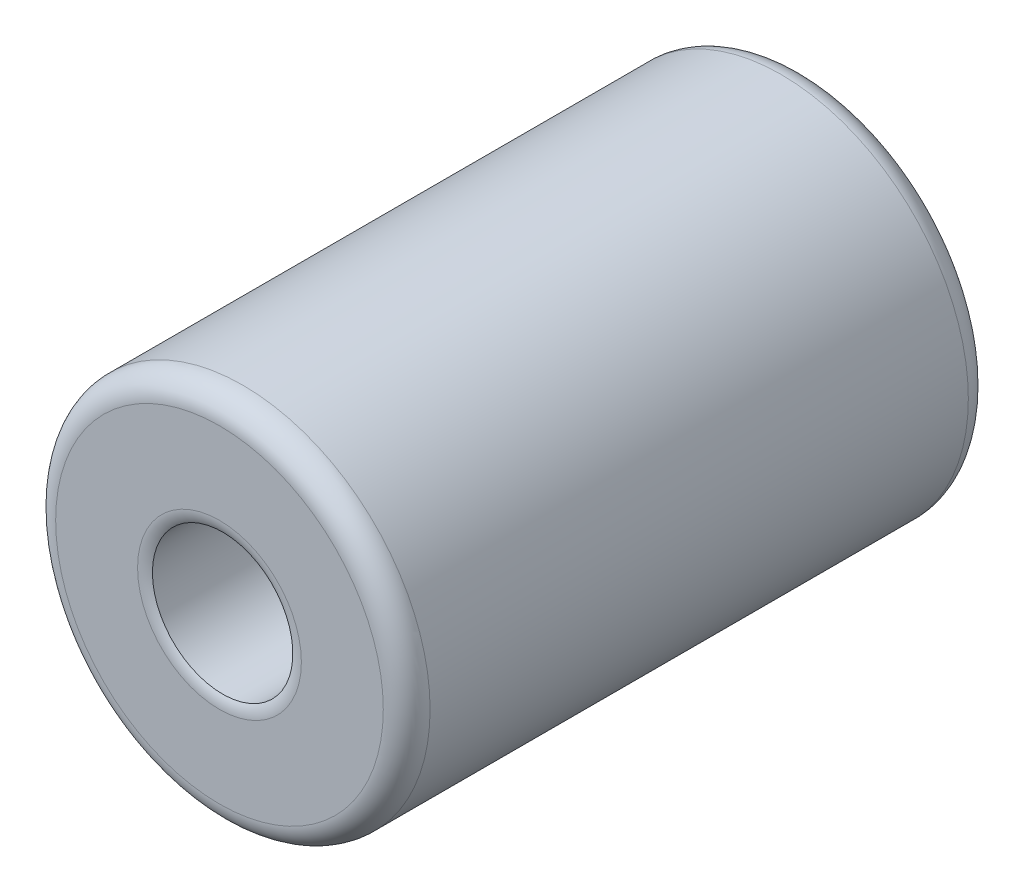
ISO-10303-21;
HEADER;
FILE_DESCRIPTION(('STEP AP214'),'2;1');
FILE_NAME('part.step','',(''),(''),'','','');
FILE_SCHEMA(('AUTOMOTIVE_DESIGN { 1 0 10303 214 1 1 1 1 }'));
ENDSEC;
DATA;
#1=APPLICATION_CONTEXT('core data for automotive mechanical design processes');
#2=APPLICATION_PROTOCOL_DEFINITION('international standard','automotive_design',2000,#1);
#3=PRODUCT_CONTEXT('',#1,'mechanical');
#4=PRODUCT('Part','Part','',(#3));
#5=PRODUCT_RELATED_PRODUCT_CATEGORY('part','',(#4));
#6=PRODUCT_DEFINITION_FORMATION('','',#4);
#7=PRODUCT_DEFINITION_CONTEXT('part definition',#1,'design');
#8=PRODUCT_DEFINITION('design','',#6,#7);
#9=PRODUCT_DEFINITION_SHAPE('','',#8);
#10=(LENGTH_UNIT() NAMED_UNIT(*) SI_UNIT(.MILLI.,.METRE.));
#11=(NAMED_UNIT(*) PLANE_ANGLE_UNIT() SI_UNIT($,.RADIAN.));
#12=(NAMED_UNIT(*) SI_UNIT($,.STERADIAN.) SOLID_ANGLE_UNIT());
#13=UNCERTAINTY_MEASURE_WITH_UNIT(LENGTH_MEASURE(1.E-05),#10,'distance_accuracy_value','');
#14=(GEOMETRIC_REPRESENTATION_CONTEXT(3) GLOBAL_UNCERTAINTY_ASSIGNED_CONTEXT((#13)) GLOBAL_UNIT_ASSIGNED_CONTEXT((#10,
#11,#12)) REPRESENTATION_CONTEXT('',''));
#15=CARTESIAN_POINT('',(0.,0.,0.));
#16=DIRECTION('',(0.,0.,1.));
#17=DIRECTION('',(1.,0.,0.));
#18=AXIS2_PLACEMENT_3D('',#15,#16,#17);
#19=CARTESIAN_POINT('',(0.,0.,-10.));
#20=DIRECTION('',(0.,0.,-1.));
#21=DIRECTION('',(-1.,0.,0.));
#22=AXIS2_PLACEMENT_3D('',#19,#20,#21);
#23=PLANE('',#22);
#24=CARTESIAN_POINT('',(0.,0.,-10.));
#25=DIRECTION('',(0.,0.,-1.));
#26=DIRECTION('',(-1.,0.,0.));
#27=AXIS2_PLACEMENT_3D('',#24,#25,#26);
#28=CIRCLE('',#27,3.);
#29=CARTESIAN_POINT('',(1.3228756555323,-2.69258240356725,-10.));
#30=VERTEX_POINT('',#29);
#31=CARTESIAN_POINT('',(-1.32287565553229,-2.69258240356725,-10.));
#32=VERTEX_POINT('',#31);
#33=EDGE_CURVE('E82',#30,#32,#28,.F.);
#34=ORIENTED_EDGE('',*,*,#33,.T.);
#35=DIRECTION('',(0.,1.,0.));
#36=VECTOR('',#35,1.);
#37=CARTESIAN_POINT('',(-1.32287565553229,0.,-10.));
#38=LINE('',#37,#36);
#39=CARTESIAN_POINT('',(-1.32287565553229,-3.77491721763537,-10.));
#40=VERTEX_POINT('',#39);
#41=EDGE_CURVE('E74',#32,#40,#38,.F.);
#42=ORIENTED_EDGE('',*,*,#41,.T.);
#43=CARTESIAN_POINT('',(0.,0.,-10.));
#44=DIRECTION('',(0.,0.,1.));
#45=DIRECTION('',(1.,0.,0.));
#46=AXIS2_PLACEMENT_3D('',#43,#44,#45);
#47=CIRCLE('',#46,4.);
#48=CARTESIAN_POINT('',(1.3228756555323,-3.77491721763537,-10.));
#49=VERTEX_POINT('',#48);
#50=EDGE_CURVE('E84',#40,#49,#47,.F.);
#51=ORIENTED_EDGE('',*,*,#50,.T.);
#52=DIRECTION('',(0.,1.,0.));
#53=VECTOR('',#52,1.);
#54=CARTESIAN_POINT('',(1.3228756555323,0.,-10.));
#55=LINE('',#54,#53);
#56=EDGE_CURVE('E73',#49,#30,#55,.T.);
#57=ORIENTED_EDGE('',*,*,#56,.T.);
#58=EDGE_LOOP('',(#34,#42,#51,#57));
#59=FACE_BOUND('',#58,.T.);
#60=ADVANCED_FACE('F17',(#59),#23,.T.);
#61=CARTESIAN_POINT('',(0.,0.,-24.));
#62=DIRECTION('',(0.,0.,1.));
#63=DIRECTION('',(1.,0.,0.));
#64=AXIS2_PLACEMENT_3D('',#61,#62,#63);
#65=TOROIDAL_SURFACE('',#64,5.,1.);
#66=CARTESIAN_POINT('',(0.,0.,-25.));
#67=DIRECTION('',(0.,0.,-1.));
#68=DIRECTION('',(1.,0.,0.));
#69=AXIS2_PLACEMENT_3D('',#66,#67,#68);
#70=CIRCLE('',#69,5.);
#71=CARTESIAN_POINT('',(5.,0.,-25.));
#72=VERTEX_POINT('',#71);
#73=CARTESIAN_POINT('',(-5.,0.,-25.));
#74=VERTEX_POINT('',#73);
#75=EDGE_CURVE('E210',#72,#74,#70,.T.);
#76=ORIENTED_EDGE('',*,*,#75,.T.);
#77=CARTESIAN_POINT('',(0.,0.,-25.));
#78=DIRECTION('',(0.,0.,-1.));
#79=DIRECTION('',(-1.,0.,0.));
#80=AXIS2_PLACEMENT_3D('',#77,#78,#79);
#81=CIRCLE('',#80,5.);
#82=EDGE_CURVE('E220',#74,#72,#81,.T.);
#83=ORIENTED_EDGE('',*,*,#82,.T.);
#84=EDGE_LOOP('',(#76,#83));
#85=FACE_BOUND('',#84,.T.);
#86=CARTESIAN_POINT('',(0.,0.,-24.));
#87=DIRECTION('',(0.,0.,1.));
#88=DIRECTION('',(1.,0.,0.));
#89=AXIS2_PLACEMENT_3D('',#86,#87,#88);
#90=CIRCLE('',#89,4.);
#91=CARTESIAN_POINT('',(4.,0.,-24.));
#92=VERTEX_POINT('',#91);
#93=EDGE_CURVE('E267',#92,#92,#90,.T.);
#94=ORIENTED_EDGE('',*,*,#93,.T.);
#95=EDGE_LOOP('',(#94));
#96=FACE_BOUND('',#95,.T.);
#97=ADVANCED_FACE('F247',(#85,#96),#65,.T.);
#98=CARTESIAN_POINT('',(0.,0.,-1.));
#99=DIRECTION('',(0.,0.,-1.));
#100=DIRECTION('',(-1.,0.,0.));
#101=AXIS2_PLACEMENT_3D('',#98,#99,#100);
#102=TOROIDAL_SURFACE('',#101,3.5,1.);
#103=CARTESIAN_POINT('',(0.,0.,0.));
#104=DIRECTION('',(0.,0.,1.));
#105=DIRECTION('',(-1.,0.,0.));
#106=AXIS2_PLACEMENT_3D('',#103,#104,#105);
#107=CIRCLE('',#106,3.5);
#108=CARTESIAN_POINT('',(-3.5,0.,0.));
#109=VERTEX_POINT('',#108);
#110=CARTESIAN_POINT('',(3.5,0.,0.));
#111=VERTEX_POINT('',#110);
#112=EDGE_CURVE('E268',#109,#111,#107,.T.);
#113=ORIENTED_EDGE('',*,*,#112,.T.);
#114=CARTESIAN_POINT('',(0.,0.,0.));
#115=DIRECTION('',(0.,0.,1.));
#116=DIRECTION('',(1.,0.,0.));
#117=AXIS2_PLACEMENT_3D('',#114,#115,#116);
#118=CIRCLE('',#117,3.5);
#119=EDGE_CURVE('E167',#111,#109,#118,.T.);
#120=ORIENTED_EDGE('',*,*,#119,.T.);
#121=EDGE_LOOP('',(#113,#120));
#122=FACE_BOUND('',#121,.T.);
#123=CARTESIAN_POINT('',(0.,0.,-0.133974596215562));
#124=DIRECTION('',(0.,0.,-1.));
#125=DIRECTION('',(-1.,0.,0.));
#126=AXIS2_PLACEMENT_3D('',#123,#124,#125);
#127=CIRCLE('',#126,3.);
#128=CARTESIAN_POINT('',(-3.,0.,-0.133974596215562));
#129=VERTEX_POINT('',#128);
#130=EDGE_CURVE('E89',#129,#129,#127,.T.);
#131=ORIENTED_EDGE('',*,*,#130,.T.);
#132=EDGE_LOOP('',(#131));
#133=FACE_BOUND('',#132,.T.);
#134=ADVANCED_FACE('F243',(#122,#133),#102,.T.);
#135=CARTESIAN_POINT('',(0.,0.,9.00000000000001));
#136=DIRECTION('',(0.,0.,-1.));
#137=DIRECTION('',(-1.,0.,0.));
#138=AXIS2_PLACEMENT_3D('',#135,#136,#137);
#139=CYLINDRICAL_SURFACE('',#138,3.);
#140=CARTESIAN_POINT('',(1.3228756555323,-2.69258240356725,-10.));
#141=CARTESIAN_POINT('',(1.36613636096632,-2.67132944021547,-9.96183388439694));
#142=CARTESIAN_POINT('',(1.40761017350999,-2.64965654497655,-9.92194274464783));
#143=CARTESIAN_POINT('',(1.48691050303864,-2.60598328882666,-9.83880897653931));
#144=CARTESIAN_POINT('',(1.52473526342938,-2.5839827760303,-9.79556475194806));
#145=CARTESIAN_POINT('',(1.63309902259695,-2.51796589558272,-9.66034261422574));
#146=CARTESIAN_POINT('',(1.69788235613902,-2.47426511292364,-9.5634447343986));
#147=CARTESIAN_POINT('',(1.80064994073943,-2.40020002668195,-9.37580372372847));
#148=CARTESIAN_POINT('',(1.84133599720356,-2.36883832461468,-9.28692428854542));
#149=CARTESIAN_POINT('',(1.90970394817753,-2.31407735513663,-9.10221203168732));
#150=CARTESIAN_POINT('',(1.93743412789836,-2.29064861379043,-9.00640659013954));
#151=CARTESIAN_POINT('',(1.97518897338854,-2.25813096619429,-8.82523879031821));
#152=CARTESIAN_POINT('',(1.98732203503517,-2.24735877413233,-8.74062518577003));
#153=CARTESIAN_POINT('',(2.00060960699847,-2.23554220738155,-8.56986029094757));
#154=CARTESIAN_POINT('',(2.00176939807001,-2.23449315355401,-8.48370976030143));
#155=CARTESIAN_POINT('',(1.99303789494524,-2.24228188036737,-8.31253870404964));
#156=CARTESIAN_POINT('',(1.98315801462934,-2.25110944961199,-8.22751710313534));
#157=CARTESIAN_POINT('',(1.95299801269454,-2.27732026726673,-8.06067127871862));
#158=CARTESIAN_POINT('',(1.93270420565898,-2.29471477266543,-7.97885141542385));
#159=CARTESIAN_POINT('',(1.87474419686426,-2.34246489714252,-7.79475871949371));
#160=CARTESIAN_POINT('',(1.83361425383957,-2.37517950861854,-7.69419655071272));
#161=CARTESIAN_POINT('',(1.73692469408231,-2.44677565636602,-7.50268067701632));
#162=CARTESIAN_POINT('',(1.68134418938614,-2.48566608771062,-7.41174115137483));
#163=CARTESIAN_POINT('',(1.55592339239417,-2.56607620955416,-7.23876918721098));
#164=CARTESIAN_POINT('',(1.48584625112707,-2.6076304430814,-7.1569247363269));
#165=CARTESIAN_POINT('',(1.33297598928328,-2.68899500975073,-7.00507575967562));
#166=CARTESIAN_POINT('',(1.25017962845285,-2.72880489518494,-6.93507426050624));
#167=CARTESIAN_POINT('',(1.06305642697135,-2.80735214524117,-6.80163510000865));
#168=CARTESIAN_POINT('',(0.957371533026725,-2.84551327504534,-6.73971399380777));
#169=CARTESIAN_POINT('',(0.789879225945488,-2.89473601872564,-6.66155093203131));
#170=CARTESIAN_POINT('',(0.732576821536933,-2.90980307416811,-6.63795560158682));
#171=CARTESIAN_POINT('',(0.615387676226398,-2.93681917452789,-6.59601310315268));
#172=CARTESIAN_POINT('',(0.555502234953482,-2.94876976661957,-6.57766333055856));
#173=CARTESIAN_POINT('',(0.414560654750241,-2.9723235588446,-6.54169734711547));
#174=CARTESIAN_POINT('',(0.33275364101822,-2.98264309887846,-6.52611491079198));
#175=CARTESIAN_POINT('',(0.167306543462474,-2.99648223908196,-6.50526570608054));
#176=CARTESIAN_POINT('',(0.0836670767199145,-3.00000409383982,-6.49999551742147));
#177=CARTESIAN_POINT('',(-0.100443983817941,-2.99999508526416,-6.50000538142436));
#178=CARTESIAN_POINT('',(-0.200927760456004,-2.99490840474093,-6.50761287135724));
#179=CARTESIAN_POINT('',(-0.398705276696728,-2.97505309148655,-6.53758748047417));
#180=CARTESIAN_POINT('',(-0.495996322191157,-2.96027649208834,-6.55996674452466));
#181=CARTESIAN_POINT('',(-0.684212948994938,-2.92250399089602,-6.61810884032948));
#182=CARTESIAN_POINT('',(-0.775166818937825,-2.89954784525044,-6.6538069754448));
#183=CARTESIAN_POINT('',(-0.949419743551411,-2.84726006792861,-6.73706554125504));
#184=CARTESIAN_POINT('',(-1.03271805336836,-2.81792781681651,-6.78462712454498));
#185=CARTESIAN_POINT('',(-1.1972845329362,-2.75227327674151,-6.89465694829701));
#186=CARTESIAN_POINT('',(-1.27778020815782,-2.71556899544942,-6.95804782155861));
#187=CARTESIAN_POINT('',(-1.42772802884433,-2.63982316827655,-7.09572998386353));
#188=CARTESIAN_POINT('',(-1.49716404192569,-2.60077832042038,-7.17003689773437));
#189=CARTESIAN_POINT('',(-1.63422294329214,-2.51728265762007,-7.34105234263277));
#190=CARTESIAN_POINT('',(-1.6998318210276,-2.47295070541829,-7.43944559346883));
#191=CARTESIAN_POINT('',(-1.8135035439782,-2.39084149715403,-7.6483633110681));
#192=CARTESIAN_POINT('',(-1.86159672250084,-2.35305296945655,-7.75886637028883));
#193=CARTESIAN_POINT('',(-1.92674009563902,-2.29976287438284,-7.956710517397));
#194=CARTESIAN_POINT('',(-1.94874406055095,-2.28097663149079,-8.04152684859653));
#195=CARTESIAN_POINT('',(-1.98150597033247,-2.25257988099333,-8.21474283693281));
#196=CARTESIAN_POINT('',(-1.99228308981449,-2.24295373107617,-8.30313611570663));
#197=CARTESIAN_POINT('',(-2.00191390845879,-2.23436582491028,-8.48147950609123));
#198=CARTESIAN_POINT('',(-2.00071834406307,-2.23544813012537,-8.57143452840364));
#199=CARTESIAN_POINT('',(-1.98637437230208,-2.24819900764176,-8.74964441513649));
#200=CARTESIAN_POINT('',(-1.97321710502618,-2.25987542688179,-8.83789796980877));
#201=CARTESIAN_POINT('',(-1.93665429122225,-2.29126819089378,-9.0064476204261));
#202=CARTESIAN_POINT('',(-1.91372847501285,-2.31060552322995,-9.08692303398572));
#203=CARTESIAN_POINT('',(-1.85871555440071,-2.35508478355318,-9.24298901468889));
#204=CARTESIAN_POINT('',(-1.826621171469,-2.38023132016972,-9.31857564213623));
#205=CARTESIAN_POINT('',(-1.74669732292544,-2.43967308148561,-9.47911017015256));
#206=CARTESIAN_POINT('',(-1.69699267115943,-2.47478777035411,-9.56281505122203));
#207=CARTESIAN_POINT('',(-1.58655585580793,-2.54699568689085,-9.72154680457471));
#208=CARTESIAN_POINT('',(-1.52583213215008,-2.58408738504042,-9.79658024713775));
#209=CARTESIAN_POINT('',(-1.43822848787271,-2.63289241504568,-9.89014802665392));
#210=CARTESIAN_POINT('',(-1.41591215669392,-2.64496899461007,-9.91287273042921));
#211=CARTESIAN_POINT('',(-1.37020379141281,-2.66893333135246,-9.95724188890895));
#212=CARTESIAN_POINT('',(-1.34681332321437,-2.68082133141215,-9.97888782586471));
#213=CARTESIAN_POINT('',(-1.3228756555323,-2.69258240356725,-10.));
#214=B_SPLINE_CURVE_WITH_KNOTS('',3,(#140,#141,#142,#143,#144,#145,#146,#147,#148,#149,#150,
#151,#152,#153,#154,#155,#156,#157,#158,#159,#160,#161,#162,#163,#164,#165,#166,#167,#168,#169,
#170,#171,#172,#173,#174,#175,#176,#177,#178,#179,#180,#181,#182,#183,#184,#185,#186,#187,#188,
#189,#190,#191,#192,#193,#194,#195,#196,#197,#198,#199,#200,#201,#202,#203,#204,#205,#206,#207,
#208,#209,#210,#211,#212,#213),.UNSPECIFIED.,.F.,.F.,(4,2,2,2,2,2,2,2,2,2,2,2,2,2,2,2,2,2,2,2,2,
2,2,2,2,2,2,2,2,2,2,2,2,2,2,2,4),(0.,0.1843101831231,0.368708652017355,0.740240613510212,
1.04711332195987,1.35283304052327,1.61014018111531,1.86732348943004,2.12424114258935,
2.38149729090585,2.72007598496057,3.05914683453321,3.40427067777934,3.74948258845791,
4.13183651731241,4.32287421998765,4.51381690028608,4.76462550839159,5.01535091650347,
5.31635173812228,5.61760034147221,5.91740428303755,6.21723736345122,6.54252109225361,
6.86827504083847,7.2454176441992,7.62190397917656,7.88968534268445,8.15700860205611,
8.42543225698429,8.69405489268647,8.95077965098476,9.20770878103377,9.51713636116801,
9.82632793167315,9.92849095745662,10.0305095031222),.UNSPECIFIED.);
#215=EDGE_CURVE('E69',#30,#32,#214,.T.);
#216=ORIENTED_EDGE('',*,*,#215,.T.);
#217=ORIENTED_EDGE('',*,*,#33,.F.);
#218=EDGE_LOOP('',(#216,#217));
#219=FACE_BOUND('',#218,.T.);
#220=ORIENTED_EDGE('',*,*,#130,.F.);
#221=EDGE_LOOP('',(#220));
#222=FACE_BOUND('',#221,.T.);
#223=ADVANCED_FACE('F87',(#219,#222),#139,.F.);
#224=CARTESIAN_POINT('',(0.,0.,0.));
#225=DIRECTION('',(0.,0.,1.));
#226=DIRECTION('',(1.,0.,0.));
#227=AXIS2_PLACEMENT_3D('',#224,#225,#226);
#228=CYLINDRICAL_SURFACE('',#227,4.);
#229=CARTESIAN_POINT('',(-1.32287565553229,-3.77491721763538,-10.));
#230=CARTESIAN_POINT('',(-1.28251308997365,-3.7890620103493,-10.0355901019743));
#231=CARTESIAN_POINT('',(-1.24069318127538,-3.80298918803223,-10.0695802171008));
#232=CARTESIAN_POINT('',(-1.15426992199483,-3.83010662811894,-10.1341912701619));
#233=CARTESIAN_POINT('',(-1.10966521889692,-3.84329652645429,-10.1648105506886));
#234=CARTESIAN_POINT('',(-0.971485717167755,-3.88140988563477,-10.2515886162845));
#235=CARTESIAN_POINT('',(-0.873941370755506,-3.90473322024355,-10.3023172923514));
#236=CARTESIAN_POINT('',(-0.670364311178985,-3.944796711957,-10.387549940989));
#237=CARTESIAN_POINT('',(-0.564304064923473,-3.96151438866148,-10.4219985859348));
#238=CARTESIAN_POINT('',(-0.347325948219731,-3.98637410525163,-10.4727326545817));
#239=CARTESIAN_POINT('',(-0.236433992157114,-3.99455714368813,-10.4891049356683));
#240=CARTESIAN_POINT('',(-0.104216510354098,-3.99869717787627,-10.4973926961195));
#241=CARTESIAN_POINT('',(-0.0833930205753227,-3.99918493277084,-10.4983694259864));
#242=CARTESIAN_POINT('',(-0.0417153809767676,-3.99983675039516,-10.4996735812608));
#243=CARTESIAN_POINT('',(-0.0208612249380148,-4.00000073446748,-10.5000008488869));
#244=CARTESIAN_POINT('',(0.105069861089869,-3.9999963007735,-10.4999957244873));
#245=CARTESIAN_POINT('',(0.210319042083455,-3.99581411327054,-10.4916679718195));
#246=CARTESIAN_POINT('',(0.417767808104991,-3.97949197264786,-10.4587126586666));
#247=CARTESIAN_POINT('',(0.519958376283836,-3.96733052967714,-10.4340410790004));
#248=CARTESIAN_POINT('',(0.717921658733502,-3.93631755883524,-10.3695957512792));
#249=CARTESIAN_POINT('',(0.813716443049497,-3.91749061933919,-10.329877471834));
#250=CARTESIAN_POINT('',(0.997067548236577,-3.87488137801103,-10.2367822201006));
#251=CARTESIAN_POINT('',(1.08463443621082,-3.85110556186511,-10.1834231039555));
#252=CARTESIAN_POINT('',(1.19429830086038,-3.81765059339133,-10.1046067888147));
#253=CARTESIAN_POINT('',(1.22079859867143,-3.80925189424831,-10.0845364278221));
#254=CARTESIAN_POINT('',(1.27267268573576,-3.79223486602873,-10.0431785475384));
#255=CARTESIAN_POINT('',(1.29804848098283,-3.78361697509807,-10.0218933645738));
#256=CARTESIAN_POINT('',(1.3228756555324,-3.77491721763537,-10.0000000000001));
#257=B_SPLINE_CURVE_WITH_KNOTS('',3,(#229,#230,#231,#232,#233,#234,#235,#236,#237,#238,#239,
#240,#241,#242,#243,#244,#245,#246,#247,#248,#249,#250,#251,#252,#253,#254,#255,#256),
.UNSPECIFIED.,.F.,.F.,(4,2,2,2,2,2,2,2,2,2,2,2,2,4),(0.,0.166832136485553,0.333745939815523,
0.669197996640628,1.005782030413,1.34074163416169,1.40329273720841,1.46585903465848,
1.78098109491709,2.09695534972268,2.41177594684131,2.72618652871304,2.82902071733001,
2.93166339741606),.UNSPECIFIED.);
#258=EDGE_CURVE('E78',#40,#49,#257,.T.);
#259=ORIENTED_EDGE('',*,*,#258,.T.);
#260=ORIENTED_EDGE('',*,*,#50,.F.);
#261=EDGE_LOOP('',(#259,#260));
#262=FACE_BOUND('',#261,.T.);
#263=CARTESIAN_POINT('',(0.,-4.,-15.));
#264=CARTESIAN_POINT('',(-0.126918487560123,-3.99999447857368,-15.0000060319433));
#265=CARTESIAN_POINT('',(-0.254071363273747,-3.9938924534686,-15.0097369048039));
#266=CARTESIAN_POINT('',(-0.504544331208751,-3.97005773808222,-15.0481478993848));
#267=CARTESIAN_POINT('',(-0.627852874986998,-3.95229299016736,-15.0768802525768));
#268=CARTESIAN_POINT('',(-0.866421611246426,-3.90691461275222,-15.1516268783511));
#269=CARTESIAN_POINT('',(-0.981720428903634,-3.87935283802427,-15.1975502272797));
#270=CARTESIAN_POINT('',(-1.2025462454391,-3.81668374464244,-15.3047860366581));
#271=CARTESIAN_POINT('',(-1.30807658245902,-3.78157901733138,-15.3660932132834));
#272=CARTESIAN_POINT('',(-1.51594490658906,-3.70340427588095,-15.5077709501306));
#273=CARTESIAN_POINT('',(-1.61735305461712,-3.65992181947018,-15.5892737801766));
#274=CARTESIAN_POINT('',(-1.80596768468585,-3.57062969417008,-15.7664327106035));
#275=CARTESIAN_POINT('',(-1.89315389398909,-3.52481682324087,-15.862108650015));
#276=CARTESIAN_POINT('',(-2.06285799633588,-3.42860805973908,-16.0800685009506));
#277=CARTESIAN_POINT('',(-2.14314509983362,-3.37843160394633,-16.2042010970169));
#278=CARTESIAN_POINT('',(-2.28148003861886,-3.28660345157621,-16.467131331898));
#279=CARTESIAN_POINT('',(-2.33956569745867,-3.24493731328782,-16.605903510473));
#280=CARTESIAN_POINT('',(-2.41866799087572,-3.18619152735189,-16.8576209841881));
#281=CARTESIAN_POINT('',(-2.44539101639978,-3.16553814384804,-16.9679335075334));
#282=CARTESIAN_POINT('',(-2.48363685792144,-3.13562715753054,-17.1926117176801));
#283=CARTESIAN_POINT('',(-2.4951811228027,-3.12635347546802,-17.3069714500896));
#284=CARTESIAN_POINT('',(-2.50237836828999,-3.12059771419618,-17.5368260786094));
#285=CARTESIAN_POINT('',(-2.49798967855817,-3.12414917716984,-17.6523231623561));
#286=CARTESIAN_POINT('',(-2.47352631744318,-3.143548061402,-17.8806202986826));
#287=CARTESIAN_POINT('',(-2.45343908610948,-3.15940532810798,-17.9934181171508));
#288=CARTESIAN_POINT('',(-2.39936227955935,-3.20065131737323,-18.21087615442));
#289=CARTESIAN_POINT('',(-2.36570090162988,-3.22581393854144,-18.3156634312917));
#290=CARTESIAN_POINT('',(-2.28580433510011,-3.28291090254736,-18.5183210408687));
#291=CARTESIAN_POINT('',(-2.23956452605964,-3.31484773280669,-18.6161888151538));
#292=CARTESIAN_POINT('',(-2.12589529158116,-3.38909822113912,-18.8216718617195));
#293=CARTESIAN_POINT('',(-2.05612092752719,-3.43223577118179,-18.9276914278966));
#294=CARTESIAN_POINT('',(-1.90175280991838,-3.52011890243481,-19.1276703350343));
#295=CARTESIAN_POINT('',(-1.81714526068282,-3.56486594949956,-19.2216183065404));
#296=CARTESIAN_POINT('',(-1.61907797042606,-3.65958206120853,-19.4105718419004));
#297=CARTESIAN_POINT('',(-1.50316133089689,-3.70919723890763,-19.5032027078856));
#298=CARTESIAN_POINT('',(-1.25434055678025,-3.80054199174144,-19.6676704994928));
#299=CARTESIAN_POINT('',(-1.12143338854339,-3.84227015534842,-19.7395037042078));
#300=CARTESIAN_POINT('',(-0.91568606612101,-3.89438259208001,-19.8273844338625));
#301=CARTESIAN_POINT('',(-0.848010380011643,-3.90971053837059,-19.8529038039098));
#302=CARTESIAN_POINT('',(-0.710115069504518,-3.93708785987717,-19.8981218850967));
#303=CARTESIAN_POINT('',(-0.639897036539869,-3.94913924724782,-19.9178241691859));
#304=CARTESIAN_POINT('',(-0.497732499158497,-3.9695600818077,-19.9510359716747));
#305=CARTESIAN_POINT('',(-0.425792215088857,-3.97794113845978,-19.964565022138));
#306=CARTESIAN_POINT('',(-0.280701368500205,-3.99080197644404,-19.9852700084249));
#307=CARTESIAN_POINT('',(-0.207551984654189,-3.99528535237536,-19.9924517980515));
#308=CARTESIAN_POINT('',(-0.11185830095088,-3.99849828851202,-19.9975966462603));
#309=CARTESIAN_POINT('',(-0.0895006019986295,-3.99906094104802,-19.9984973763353));
#310=CARTESIAN_POINT('',(-0.0447643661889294,-3.99981228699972,-19.9996995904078));
#311=CARTESIAN_POINT('',(-0.0223858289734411,-4.00000097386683,-20.0000010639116));
#312=CARTESIAN_POINT('',(0.126918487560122,-3.99999447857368,-19.9999939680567));
#313=CARTESIAN_POINT('',(0.254071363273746,-3.9938924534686,-19.9902630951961));
#314=CARTESIAN_POINT('',(0.50454433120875,-3.97005773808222,-19.9518521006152));
#315=CARTESIAN_POINT('',(0.627852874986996,-3.95229299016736,-19.9231197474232));
#316=CARTESIAN_POINT('',(0.866421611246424,-3.90691461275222,-19.8483731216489));
#317=CARTESIAN_POINT('',(0.981720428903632,-3.87935283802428,-19.8024497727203));
#318=CARTESIAN_POINT('',(1.2025462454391,-3.81668374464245,-19.6952139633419));
#319=CARTESIAN_POINT('',(1.30807658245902,-3.78157901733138,-19.6339067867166));
#320=CARTESIAN_POINT('',(1.51594490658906,-3.70340427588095,-19.4922290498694));
#321=CARTESIAN_POINT('',(1.61735305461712,-3.65992181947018,-19.4107262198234));
#322=CARTESIAN_POINT('',(1.80596768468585,-3.57062969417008,-19.2335672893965));
#323=CARTESIAN_POINT('',(1.89315389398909,-3.52481682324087,-19.137891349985));
#324=CARTESIAN_POINT('',(2.06285799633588,-3.42860805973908,-18.9199314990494));
#325=CARTESIAN_POINT('',(2.14314509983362,-3.37843160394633,-18.7957989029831));
#326=CARTESIAN_POINT('',(2.28148003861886,-3.28660345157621,-18.532868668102));
#327=CARTESIAN_POINT('',(2.33956569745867,-3.24493731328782,-18.394096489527));
#328=CARTESIAN_POINT('',(2.41866799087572,-3.18619152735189,-18.1423790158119));
#329=CARTESIAN_POINT('',(2.44539101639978,-3.16553814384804,-18.0320664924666));
#330=CARTESIAN_POINT('',(2.48363685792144,-3.13562715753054,-17.80738828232));
#331=CARTESIAN_POINT('',(2.4951811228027,-3.12635347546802,-17.6930285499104));
#332=CARTESIAN_POINT('',(2.50237836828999,-3.12059771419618,-17.4631739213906));
#333=CARTESIAN_POINT('',(2.49798967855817,-3.12414917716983,-17.3476768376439));
#334=CARTESIAN_POINT('',(2.47352631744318,-3.143548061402,-17.1193797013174));
#335=CARTESIAN_POINT('',(2.45343908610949,-3.15940532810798,-17.0065818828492));
#336=CARTESIAN_POINT('',(2.39936227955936,-3.20065131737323,-16.78912384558));
#337=CARTESIAN_POINT('',(2.36570090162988,-3.22581393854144,-16.6843365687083));
#338=CARTESIAN_POINT('',(2.28580433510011,-3.28291090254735,-16.4816789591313));
#339=CARTESIAN_POINT('',(2.23956452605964,-3.31484773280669,-16.3838111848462));
#340=CARTESIAN_POINT('',(2.12589529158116,-3.38909822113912,-16.1783281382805));
#341=CARTESIAN_POINT('',(2.0561209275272,-3.43223577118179,-16.0723085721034));
#342=CARTESIAN_POINT('',(1.90175280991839,-3.5201189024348,-15.8723296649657));
#343=CARTESIAN_POINT('',(1.81714526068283,-3.56486594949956,-15.7783816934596));
#344=CARTESIAN_POINT('',(1.61907797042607,-3.65958206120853,-15.5894281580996));
#345=CARTESIAN_POINT('',(1.50316133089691,-3.70919723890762,-15.4967972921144));
#346=CARTESIAN_POINT('',(1.25434055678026,-3.80054199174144,-15.3323295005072));
#347=CARTESIAN_POINT('',(1.1214333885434,-3.84227015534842,-15.2604962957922));
#348=CARTESIAN_POINT('',(0.915686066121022,-3.89438259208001,-15.1726155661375));
#349=CARTESIAN_POINT('',(0.848010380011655,-3.90971053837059,-15.1470961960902));
#350=CARTESIAN_POINT('',(0.71011506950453,-3.93708785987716,-15.1018781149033));
#351=CARTESIAN_POINT('',(0.639897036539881,-3.94913924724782,-15.0821758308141));
#352=CARTESIAN_POINT('',(0.49773249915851,-3.96956008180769,-15.0489640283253));
#353=CARTESIAN_POINT('',(0.42579221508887,-3.97794113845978,-15.035434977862));
#354=CARTESIAN_POINT('',(0.280701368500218,-3.99080197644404,-15.0147299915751));
#355=CARTESIAN_POINT('',(0.207551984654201,-3.99528535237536,-15.0075482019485));
#356=CARTESIAN_POINT('',(0.111858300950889,-3.99849828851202,-15.0024033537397));
#357=CARTESIAN_POINT('',(0.0895006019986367,-3.99906094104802,-15.0015026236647));
#358=CARTESIAN_POINT('',(0.0447643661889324,-3.99981228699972,-15.0003004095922));
#359=CARTESIAN_POINT('',(0.022385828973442,-4.00000097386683,-14.9999989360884));
#360=CARTESIAN_POINT('',(0.,-4.,-15.));
#361=B_SPLINE_CURVE_WITH_KNOTS('',3,(#263,#264,#265,#266,#267,#268,#269,#270,#271,#272,#273,
#274,#275,#276,#277,#278,#279,#280,#281,#282,#283,#284,#285,#286,#287,#288,#289,#290,#291,#292,
#293,#294,#295,#296,#297,#298,#299,#300,#301,#302,#303,#304,#305,#306,#307,#308,#309,#310,#311,
#312,#313,#314,#315,#316,#317,#318,#319,#320,#321,#322,#323,#324,#325,#326,#327,#328,#329,#330,
#331,#332,#333,#334,#335,#336,#337,#338,#339,#340,#341,#342,#343,#344,#345,#346,#347,#348,#349,
#350,#351,#352,#353,#354,#355,#356,#357,#358,#359,#360),.UNSPECIFIED.,.T.,.F.,(4,2,2,2,2,2,2,2,
2,2,2,2,2,2,2,2,2,2,2,2,2,2,2,2,2,2,2,2,2,2,2,2,2,2,2,2,2,2,2,2,2,2,2,2,2,2,2,2,4),(0.,
0.380662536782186,0.762375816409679,1.14209809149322,1.52169012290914,1.93163168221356,
2.34215258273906,2.80826237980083,3.27357451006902,3.61823999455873,3.96241791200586,
4.30749662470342,4.65285170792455,4.99031447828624,5.32790137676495,5.72856860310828,
6.12961046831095,6.59670986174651,7.06389277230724,7.28541075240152,7.50679238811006,
7.72746863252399,7.94794114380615,8.01508106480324,8.0822221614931,8.46288469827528,
8.84459797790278,9.22432025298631,9.60391228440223,10.0138538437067,10.4243747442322,
10.8904845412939,11.3557966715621,11.7004621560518,12.044640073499,12.3897187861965,
12.7350738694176,13.0725366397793,13.410123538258,13.8107907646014,14.211832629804,
14.6789320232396,15.1461149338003,15.3676329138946,15.5890145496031,15.8096907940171,
16.0301633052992,16.0973032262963,16.1644443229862),.UNSPECIFIED.);
#362=CARTESIAN_POINT('',(0.,-4.,-15.));
#363=VERTEX_POINT('',#362);
#364=EDGE_CURVE('E77',#363,#363,#361,.T.);
#365=ORIENTED_EDGE('',*,*,#364,.T.);
#366=EDGE_LOOP('',(#365));
#367=FACE_BOUND('',#366,.T.);
#368=ORIENTED_EDGE('',*,*,#93,.F.);
#369=EDGE_LOOP('',(#368));
#370=FACE_BOUND('',#369,.T.);
#371=ADVANCED_FACE('F298',(#262,#367,#370),#228,.F.);
#372=CARTESIAN_POINT('',(0.,0.,-25.));
#373=DIRECTION('',(0.,0.,1.));
#374=DIRECTION('',(1.,0.,0.));
#375=AXIS2_PLACEMENT_3D('',#372,#373,#374);
#376=PLANE('',#375);
#377=ORIENTED_EDGE('',*,*,#75,.F.);
#378=ORIENTED_EDGE('',*,*,#82,.F.);
#379=EDGE_LOOP('',(#377,#378));
#380=FACE_BOUND('',#379,.T.);
#381=CARTESIAN_POINT('',(0.,0.,-25.));
#382=DIRECTION('',(0.,0.,1.));
#383=DIRECTION('',(1.,0.,0.));
#384=AXIS2_PLACEMENT_3D('',#381,#382,#383);
#385=CIRCLE('',#384,7.);
#386=CARTESIAN_POINT('',(7.,0.,-25.));
#387=VERTEX_POINT('',#386);
#388=CARTESIAN_POINT('',(-7.,0.,-25.));
#389=VERTEX_POINT('',#388);
#390=EDGE_CURVE('E187',#387,#389,#385,.T.);
#391=ORIENTED_EDGE('',*,*,#390,.F.);
#392=CARTESIAN_POINT('',(0.,0.,-25.));
#393=DIRECTION('',(0.,0.,1.));
#394=DIRECTION('',(-1.,0.,0.));
#395=AXIS2_PLACEMENT_3D('',#392,#393,#394);
#396=CIRCLE('',#395,7.);
#397=EDGE_CURVE('E197',#389,#387,#396,.T.);
#398=ORIENTED_EDGE('',*,*,#397,.F.);
#399=EDGE_LOOP('',(#391,#398));
#400=FACE_BOUND('',#399,.T.);
#401=ADVANCED_FACE('F144',(#380,#400),#376,.F.);
#402=CARTESIAN_POINT('',(0.,0.,0.));
#403=DIRECTION('',(0.,0.,-1.));
#404=DIRECTION('',(-1.,0.,0.));
#405=AXIS2_PLACEMENT_3D('',#402,#403,#404);
#406=PLANE('',#405);
#407=ORIENTED_EDGE('',*,*,#112,.F.);
#408=ORIENTED_EDGE('',*,*,#119,.F.);
#409=EDGE_LOOP('',(#407,#408));
#410=FACE_BOUND('',#409,.T.);
#411=CARTESIAN_POINT('',(0.,0.,0.));
#412=DIRECTION('',(0.,0.,-1.));
#413=DIRECTION('',(-1.,0.,0.));
#414=AXIS2_PLACEMENT_3D('',#411,#412,#413);
#415=CIRCLE('',#414,7.);
#416=CARTESIAN_POINT('',(-7.,0.,0.));
#417=VERTEX_POINT('',#416);
#418=CARTESIAN_POINT('',(7.,0.,0.));
#419=VERTEX_POINT('',#418);
#420=EDGE_CURVE('E129',#417,#419,#415,.T.);
#421=ORIENTED_EDGE('',*,*,#420,.F.);
#422=CARTESIAN_POINT('',(0.,0.,0.));
#423=DIRECTION('',(0.,0.,-1.));
#424=DIRECTION('',(1.,0.,0.));
#425=AXIS2_PLACEMENT_3D('',#422,#423,#424);
#426=CIRCLE('',#425,7.);
#427=EDGE_CURVE('E35',#419,#417,#426,.T.);
#428=ORIENTED_EDGE('',*,*,#427,.F.);
#429=EDGE_LOOP('',(#421,#428));
#430=FACE_BOUND('',#429,.T.);
#431=ADVANCED_FACE('F134',(#410,#430),#406,.F.);
#432=CARTESIAN_POINT('',(0.,-15.,-8.5));
#433=DIRECTION('',(0.,1.,0.));
#434=DIRECTION('',(0.,0.,1.));
#435=AXIS2_PLACEMENT_3D('',#432,#433,#434);
#436=CYLINDRICAL_SURFACE('',#435,2.);
#437=CARTESIAN_POINT('',(0.,-8.,-10.5));
#438=CARTESIAN_POINT('',(-0.110373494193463,-7.99999672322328,-10.4999943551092));
#439=CARTESIAN_POINT('',(-0.220876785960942,-7.99769043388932,-10.4908228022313));
#440=CARTESIAN_POINT('',(-0.438814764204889,-7.98870400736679,-10.454403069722));
#441=CARTESIAN_POINT('',(-0.54624327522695,-7.98201563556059,-10.4271208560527));
#442=CARTESIAN_POINT('',(-0.754705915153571,-7.96500700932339,-10.3554088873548));
#443=CARTESIAN_POINT('',(-0.855750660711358,-7.95469298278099,-10.3110085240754));
#444=CARTESIAN_POINT('',(-1.04892421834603,-7.93153418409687,-10.2064072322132));
#445=CARTESIAN_POINT('',(-1.14105532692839,-7.91869006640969,-10.1462103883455));
#446=CARTESIAN_POINT('',(-1.31573317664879,-7.89156588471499,-10.0104008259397));
#447=CARTESIAN_POINT('',(-1.39806964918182,-7.87726354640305,-9.93452207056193));
#448=CARTESIAN_POINT('',(-1.54899488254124,-7.84898237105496,-9.77006859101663));
#449=CARTESIAN_POINT('',(-1.61758133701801,-7.83500358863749,-9.68149174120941));
#450=CARTESIAN_POINT('',(-1.74003561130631,-7.80873029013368,-9.49253932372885));
#451=CARTESIAN_POINT('',(-1.79367003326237,-7.79646383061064,-9.39200824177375));
#452=CARTESIAN_POINT('',(-1.88319616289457,-7.77532652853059,-9.18300127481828));
#453=CARTESIAN_POINT('',(-1.91909084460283,-7.76645511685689,-9.07452672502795));
#454=CARTESIAN_POINT('',(-1.97140643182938,-7.75333969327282,-8.85500873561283));
#455=CARTESIAN_POINT('',(-1.98820300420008,-7.74900655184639,-8.74406027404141));
#456=CARTESIAN_POINT('',(-2.00301570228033,-7.74519149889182,-8.52084204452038));
#457=CARTESIAN_POINT('',(-2.00103486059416,-7.74570880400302,-8.40857249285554));
#458=CARTESIAN_POINT('',(-1.9786487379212,-7.75145606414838,-8.18877928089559));
#459=CARTESIAN_POINT('',(-1.95869125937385,-7.7565714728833,-8.08120654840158));
#460=CARTESIAN_POINT('',(-1.90163248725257,-7.7707560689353,-7.87098594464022));
#461=CARTESIAN_POINT('',(-1.86452985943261,-7.77982556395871,-7.76833845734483));
#462=CARTESIAN_POINT('',(-1.77385113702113,-7.80100187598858,-7.56967929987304));
#463=CARTESIAN_POINT('',(-1.72011205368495,-7.81313851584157,-7.47374533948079));
#464=CARTESIAN_POINT('',(-1.59780365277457,-7.83906373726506,-7.29210261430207));
#465=CARTESIAN_POINT('',(-1.52923273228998,-7.85285249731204,-7.20639495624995));
#466=CARTESIAN_POINT('',(-1.37690039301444,-7.88100889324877,-7.04507820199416));
#467=CARTESIAN_POINT('',(-1.29276350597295,-7.89538185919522,-6.96982419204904));
#468=CARTESIAN_POINT('',(-1.11285269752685,-7.92274099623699,-6.83439567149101));
#469=CARTESIAN_POINT('',(-1.01707379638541,-7.93572656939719,-6.77422764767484));
#470=CARTESIAN_POINT('',(-0.816064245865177,-7.95891419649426,-6.67055011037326));
#471=CARTESIAN_POINT('',(-0.710795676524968,-7.96910435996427,-6.62711144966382));
#472=CARTESIAN_POINT('',(-0.494267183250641,-7.98545059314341,-6.55872761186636));
#473=CARTESIAN_POINT('',(-0.383020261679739,-7.9916150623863,-6.53374391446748));
#474=CARTESIAN_POINT('',(-0.225714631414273,-7.99694220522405,-6.51226063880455));
#475=CARTESIAN_POINT('',(-0.180708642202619,-7.99808605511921,-6.50766734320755));
#476=CARTESIAN_POINT('',(-0.0904757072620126,-7.99961562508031,-6.50153586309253));
#477=CARTESIAN_POINT('',(-0.0452487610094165,-8.00000134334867,-6.49999768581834));
#478=CARTESIAN_POINT('',(0.110373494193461,-7.99999672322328,-6.50000564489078));
#479=CARTESIAN_POINT('',(0.22087678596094,-7.99769043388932,-6.50917719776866));
#480=CARTESIAN_POINT('',(0.438814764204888,-7.98870400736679,-6.54559693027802));
#481=CARTESIAN_POINT('',(0.54624327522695,-7.98201563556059,-6.57287914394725));
#482=CARTESIAN_POINT('',(0.754705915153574,-7.96500700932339,-6.64459111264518));
#483=CARTESIAN_POINT('',(0.855750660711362,-7.95469298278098,-6.68899147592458));
#484=CARTESIAN_POINT('',(1.04892421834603,-7.93153418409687,-6.7935927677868));
#485=CARTESIAN_POINT('',(1.14105532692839,-7.91869006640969,-6.85378961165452));
#486=CARTESIAN_POINT('',(1.3157331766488,-7.89156588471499,-6.98959917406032));
#487=CARTESIAN_POINT('',(1.39806964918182,-7.87726354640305,-7.06547792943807));
#488=CARTESIAN_POINT('',(1.54899488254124,-7.84898237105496,-7.22993140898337));
#489=CARTESIAN_POINT('',(1.61758133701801,-7.83500358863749,-7.31850825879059));
#490=CARTESIAN_POINT('',(1.74003561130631,-7.80873029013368,-7.50746067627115));
#491=CARTESIAN_POINT('',(1.79367003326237,-7.79646383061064,-7.60799175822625));
#492=CARTESIAN_POINT('',(1.88319616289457,-7.77532652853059,-7.81699872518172));
#493=CARTESIAN_POINT('',(1.91909084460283,-7.76645511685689,-7.92547327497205));
#494=CARTESIAN_POINT('',(1.97140643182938,-7.75333969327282,-8.14499126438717));
#495=CARTESIAN_POINT('',(1.98820300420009,-7.74900655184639,-8.25593972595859));
#496=CARTESIAN_POINT('',(2.00301570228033,-7.74519149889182,-8.47915795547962));
#497=CARTESIAN_POINT('',(2.00103486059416,-7.74570880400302,-8.59142750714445));
#498=CARTESIAN_POINT('',(1.97864873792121,-7.75145606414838,-8.81122071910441));
#499=CARTESIAN_POINT('',(1.95869125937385,-7.75657147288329,-8.91879345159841));
#500=CARTESIAN_POINT('',(1.90163248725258,-7.7707560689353,-9.12901405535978));
#501=CARTESIAN_POINT('',(1.86452985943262,-7.77982556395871,-9.23166154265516));
#502=CARTESIAN_POINT('',(1.77385113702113,-7.80100187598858,-9.43032070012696));
#503=CARTESIAN_POINT('',(1.72011205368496,-7.81313851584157,-9.52625466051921));
#504=CARTESIAN_POINT('',(1.59780365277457,-7.83906373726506,-9.70789738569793));
#505=CARTESIAN_POINT('',(1.52923273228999,-7.85285249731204,-9.79360504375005));
#506=CARTESIAN_POINT('',(1.37690039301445,-7.88100889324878,-9.95492179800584));
#507=CARTESIAN_POINT('',(1.29276350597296,-7.89538185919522,-10.030175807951));
#508=CARTESIAN_POINT('',(1.11285269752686,-7.92274099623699,-10.165604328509));
#509=CARTESIAN_POINT('',(1.01707379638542,-7.93572656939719,-10.2257723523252));
#510=CARTESIAN_POINT('',(0.816064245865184,-7.95891419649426,-10.3294498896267));
#511=CARTESIAN_POINT('',(0.710795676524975,-7.96910435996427,-10.3728885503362));
#512=CARTESIAN_POINT('',(0.494267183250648,-7.98545059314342,-10.4412723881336));
#513=CARTESIAN_POINT('',(0.383020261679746,-7.99161506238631,-10.4662560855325));
#514=CARTESIAN_POINT('',(0.22571463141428,-7.99694220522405,-10.4877393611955));
#515=CARTESIAN_POINT('',(0.180708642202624,-7.99808605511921,-10.4923326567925));
#516=CARTESIAN_POINT('',(0.0904757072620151,-7.9996156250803,-10.4984641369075));
#517=CARTESIAN_POINT('',(0.0452487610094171,-8.00000134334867,-10.5000023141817));
#518=CARTESIAN_POINT('',(0.,-8.,-10.5));
#519=B_SPLINE_CURVE_WITH_KNOTS('',3,(#437,#438,#439,#440,#441,#442,#443,#444,#445,#446,#447,
#448,#449,#450,#451,#452,#453,#454,#455,#456,#457,#458,#459,#460,#461,#462,#463,#464,#465,#466,
#467,#468,#469,#470,#471,#472,#473,#474,#475,#476,#477,#478,#479,#480,#481,#482,#483,#484,#485,
#486,#487,#488,#489,#490,#491,#492,#493,#494,#495,#496,#497,#498,#499,#500,#501,#502,#503,#504,
#505,#506,#507,#508,#509,#510,#511,#512,#513,#514,#515,#516,#517,#518),.UNSPECIFIED.,.T.,.F.,(4,
2,2,2,2,2,2,2,2,2,2,2,2,2,2,2,2,2,2,2,2,2,2,2,2,2,2,2,2,2,2,2,2,2,2,2,2,2,2,2,4),(0.,
0.330946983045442,0.662517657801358,0.993521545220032,1.32443992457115,1.66151658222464,
1.99864973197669,2.34078329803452,2.68285948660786,3.01808373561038,3.35325384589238,
3.68029888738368,4.00736938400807,4.33775143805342,4.66816921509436,5.00795227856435,
5.34788119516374,5.68923436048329,6.02987300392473,6.16554783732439,6.30122299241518,
6.63216997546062,6.96374065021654,7.29474453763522,7.62566291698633,7.96273957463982,
8.29987272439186,8.6420062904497,8.98408247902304,9.31930672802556,9.65447683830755,
9.98152187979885,10.3085923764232,10.6389744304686,10.9693922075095,11.3091752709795,
11.6491041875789,11.9904573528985,12.3310959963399,12.4667708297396,12.6024459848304),.UNSPECIFIED.);
#520=CARTESIAN_POINT('',(0.,-8.,-10.5));
#521=VERTEX_POINT('',#520);
#522=EDGE_CURVE('E280',#521,#521,#519,.T.);
#523=ORIENTED_EDGE('',*,*,#522,.F.);
#524=EDGE_LOOP('',(#523));
#525=FACE_BOUND('',#524,.T.);
#526=ORIENTED_EDGE('',*,*,#215,.F.);
#527=ORIENTED_EDGE('',*,*,#56,.F.);
#528=ORIENTED_EDGE('',*,*,#258,.F.);
#529=ORIENTED_EDGE('',*,*,#41,.F.);
#530=EDGE_LOOP('',(#526,#527,#528,#529));
#531=FACE_BOUND('',#530,.T.);
#532=ADVANCED_FACE('F71',(#525,#531),#436,.F.);
#533=CARTESIAN_POINT('',(0.,-15.,-17.5));
#534=DIRECTION('',(0.,1.,0.));
#535=DIRECTION('',(0.,0.,1.));
#536=AXIS2_PLACEMENT_3D('',#533,#534,#535);
#537=CYLINDRICAL_SURFACE('',#536,2.5);
#538=ORIENTED_EDGE('',*,*,#364,.F.);
#539=EDGE_LOOP('',(#538));
#540=FACE_BOUND('',#539,.T.);
#541=CARTESIAN_POINT('',(0.,-8.,-20.));
#542=CARTESIAN_POINT('',(-0.136696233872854,-7.99999486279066,-19.9999924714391));
#543=CARTESIAN_POINT('',(-0.273538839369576,-7.99645812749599,-19.9887368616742));
#544=CARTESIAN_POINT('',(-0.543359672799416,-7.98267442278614,-19.9440794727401));
#545=CARTESIAN_POINT('',(-0.676330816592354,-7.97241587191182,-19.910639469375));
#546=CARTESIAN_POINT('',(-0.934271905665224,-7.94631394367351,-19.8228538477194));
#547=CARTESIAN_POINT('',(-1.05925832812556,-7.93048253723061,-19.7685530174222));
#548=CARTESIAN_POINT('',(-1.2983071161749,-7.89487323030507,-19.6407422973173));
#549=CARTESIAN_POINT('',(-1.4123711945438,-7.87509595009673,-19.5672354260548));
#550=CARTESIAN_POINT('',(-1.62992724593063,-7.83300483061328,-19.4006902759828));
#551=CARTESIAN_POINT('',(-1.73303436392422,-7.81063552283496,-19.3071632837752));
#552=CARTESIAN_POINT('',(-1.92239021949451,-7.76620212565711,-19.1042691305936));
#553=CARTESIAN_POINT('',(-2.00863490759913,-7.74413811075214,-18.9948981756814));
#554=CARTESIAN_POINT('',(-2.16388692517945,-7.70222283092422,-18.7601105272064));
#555=CARTESIAN_POINT('',(-2.23241606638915,-7.6824396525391,-18.6343643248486));
#556=CARTESIAN_POINT('',(-2.34719509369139,-7.64815595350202,-18.3724145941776));
#557=CARTESIAN_POINT('',(-2.3934509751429,-7.6336540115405,-18.2362138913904));
#558=CARTESIAN_POINT('',(-2.4609691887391,-7.61215214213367,-17.9615438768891));
#559=CARTESIAN_POINT('',(-2.48294218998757,-7.60493946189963,-17.8232663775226));
#560=CARTESIAN_POINT('',(-2.50349110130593,-7.59820110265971,-17.5448138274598));
#561=CARTESIAN_POINT('',(-2.50207322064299,-7.59867338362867,-17.4046392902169));
#562=CARTESIAN_POINT('',(-2.47643652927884,-7.60706377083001,-17.1322514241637));
#563=CARTESIAN_POINT('',(-2.45312128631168,-7.61468679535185,-16.9999424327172));
#564=CARTESIAN_POINT('',(-2.38581648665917,-7.63604044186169,-16.7412163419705));
#565=CARTESIAN_POINT('',(-2.34182462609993,-7.64977174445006,-16.6147999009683));
#566=CARTESIAN_POINT('',(-2.23377596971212,-7.68202134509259,-16.3692925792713));
#567=CARTESIAN_POINT('',(-2.16943495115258,-7.7006067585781,-16.2503359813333));
#568=CARTESIAN_POINT('',(-2.02271557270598,-7.74043834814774,-16.0246183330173));
#569=CARTESIAN_POINT('',(-1.94033355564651,-7.76168506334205,-15.9178597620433));
#570=CARTESIAN_POINT('',(-1.75545127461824,-7.80562654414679,-15.7144687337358));
#571=CARTESIAN_POINT('',(-1.65220788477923,-7.82834327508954,-15.6185153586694));
#572=CARTESIAN_POINT('',(-1.43076939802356,-7.87182395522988,-15.4450838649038));
#573=CARTESIAN_POINT('',(-1.31256787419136,-7.8925870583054,-15.3676137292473));
#574=CARTESIAN_POINT('',(-1.06322528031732,-7.93004255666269,-15.2328853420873));
#575=CARTESIAN_POINT('',(-0.931982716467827,-7.94669883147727,-15.1758045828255));
#576=CARTESIAN_POINT('',(-0.661263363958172,-7.97377752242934,-15.0848318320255));
#577=CARTESIAN_POINT('',(-0.521804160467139,-7.98421275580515,-15.0508921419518));
#578=CARTESIAN_POINT('',(-0.317572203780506,-7.9939447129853,-15.0194323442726));
#579=CARTESIAN_POINT('',(-0.254308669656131,-7.99620897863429,-15.0121536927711));
#580=CARTESIAN_POINT('',(-0.127374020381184,-7.99923782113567,-15.0024357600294));
#581=CARTESIAN_POINT('',(-0.0637029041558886,-8.000002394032,-14.9999964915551));
#582=CARTESIAN_POINT('',(0.136696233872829,-7.99999486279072,-15.0000075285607));
#583=CARTESIAN_POINT('',(0.273538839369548,-7.996458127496,-15.0112631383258));
#584=CARTESIAN_POINT('',(0.543359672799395,-7.98267442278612,-15.0559205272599));
#585=CARTESIAN_POINT('',(0.676330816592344,-7.97241587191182,-15.089360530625));
#586=CARTESIAN_POINT('',(0.934271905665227,-7.94631394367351,-15.1771461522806));
#587=CARTESIAN_POINT('',(1.05925832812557,-7.93048253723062,-15.2314469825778));
#588=CARTESIAN_POINT('',(1.2983071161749,-7.89487323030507,-15.3592577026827));
#589=CARTESIAN_POINT('',(1.4123711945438,-7.87509595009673,-15.4327645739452));
#590=CARTESIAN_POINT('',(1.62992724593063,-7.83300483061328,-15.5993097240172));
#591=CARTESIAN_POINT('',(1.73303436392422,-7.81063552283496,-15.6928367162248));
#592=CARTESIAN_POINT('',(1.92239021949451,-7.76620212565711,-15.8957308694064));
#593=CARTESIAN_POINT('',(2.00863490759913,-7.74413811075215,-16.0051018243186));
#594=CARTESIAN_POINT('',(2.16388692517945,-7.70222283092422,-16.2398894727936));
#595=CARTESIAN_POINT('',(2.23241606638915,-7.6824396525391,-16.3656356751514));
#596=CARTESIAN_POINT('',(2.34719509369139,-7.64815595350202,-16.6275854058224));
#597=CARTESIAN_POINT('',(2.39345097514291,-7.6336540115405,-16.7637861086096));
#598=CARTESIAN_POINT('',(2.4609691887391,-7.61215214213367,-17.0384561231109));
#599=CARTESIAN_POINT('',(2.48294218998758,-7.60493946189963,-17.1767336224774));
#600=CARTESIAN_POINT('',(2.50349110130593,-7.59820110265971,-17.4551861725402));
#601=CARTESIAN_POINT('',(2.50207322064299,-7.59867338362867,-17.5953607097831));
#602=CARTESIAN_POINT('',(2.47643652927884,-7.60706377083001,-17.8677485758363));
#603=CARTESIAN_POINT('',(2.45312128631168,-7.61468679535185,-18.0000575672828));
#604=CARTESIAN_POINT('',(2.38581648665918,-7.63604044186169,-18.2587836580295));
#605=CARTESIAN_POINT('',(2.34182462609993,-7.64977174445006,-18.3852000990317));
#606=CARTESIAN_POINT('',(2.23377596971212,-7.68202134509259,-18.6307074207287));
#607=CARTESIAN_POINT('',(2.16943495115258,-7.7006067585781,-18.7496640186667));
#608=CARTESIAN_POINT('',(2.02271557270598,-7.74043834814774,-18.9753816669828));
#609=CARTESIAN_POINT('',(1.94033355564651,-7.76168506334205,-19.0821402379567));
#610=CARTESIAN_POINT('',(1.75545127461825,-7.80562654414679,-19.2855312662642));
#611=CARTESIAN_POINT('',(1.65220788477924,-7.82834327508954,-19.3814846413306));
#612=CARTESIAN_POINT('',(1.43076939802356,-7.87182395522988,-19.5549161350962));
#613=CARTESIAN_POINT('',(1.31256787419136,-7.8925870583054,-19.6323862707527));
#614=CARTESIAN_POINT('',(1.06322528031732,-7.93004255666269,-19.7671146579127));
#615=CARTESIAN_POINT('',(0.931982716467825,-7.94669883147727,-19.8241954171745));
#616=CARTESIAN_POINT('',(0.661263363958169,-7.97377752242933,-19.9151681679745));
#617=CARTESIAN_POINT('',(0.521804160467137,-7.98421275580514,-19.9491078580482));
#618=CARTESIAN_POINT('',(0.317572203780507,-7.9939447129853,-19.9805676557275));
#619=CARTESIAN_POINT('',(0.25430866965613,-7.9962089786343,-19.987846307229));
#620=CARTESIAN_POINT('',(0.127374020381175,-7.99923782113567,-19.9975642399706));
#621=CARTESIAN_POINT('',(0.0637029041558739,-8.00000239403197,-20.0000035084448));
#622=CARTESIAN_POINT('',(0.,-8.,-20.));
#623=B_SPLINE_CURVE_WITH_KNOTS('',3,(#541,#542,#543,#544,#545,#546,#547,#548,#549,#550,#551,
#552,#553,#554,#555,#556,#557,#558,#559,#560,#561,#562,#563,#564,#565,#566,#567,#568,#569,#570,
#571,#572,#573,#574,#575,#576,#577,#578,#579,#580,#581,#582,#583,#584,#585,#586,#587,#588,#589,
#590,#591,#592,#593,#594,#595,#596,#597,#598,#599,#600,#601,#602,#603,#604,#605,#606,#607,#608,
#609,#610,#611,#612,#613,#614,#615,#616,#617,#618,#619,#620,#621,#622),.UNSPECIFIED.,.T.,.F.,(4,
2,2,2,2,2,2,2,2,2,2,2,2,2,2,2,2,2,2,2,2,2,2,2,2,2,2,2,2,2,2,2,2,2,2,2,2,2,2,2,4),(0.,
0.409843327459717,0.820394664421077,1.23006943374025,1.6396798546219,2.06074511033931,
2.48191136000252,2.91347666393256,3.34492573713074,3.76338291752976,4.18172901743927,
4.58353732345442,4.9853904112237,5.39312450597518,5.80094133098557,6.22725884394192,
6.65376015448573,7.08388858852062,7.51312773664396,7.70412159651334,7.89511596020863,
8.30495928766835,8.71551062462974,9.12518539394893,9.53479581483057,9.95586107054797,
10.3770273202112,10.8085926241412,11.2400416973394,11.6584988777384,12.0768449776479,
12.4786532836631,12.8805063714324,13.2882404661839,13.6960572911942,14.1223748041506,
14.5488761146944,14.9790045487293,15.4082436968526,15.599237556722,15.7902319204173),.UNSPECIFIED.);
#624=CARTESIAN_POINT('',(0.,-8.,-20.));
#625=VERTEX_POINT('',#624);
#626=EDGE_CURVE('E274',#625,#625,#623,.T.);
#627=ORIENTED_EDGE('',*,*,#626,.F.);
#628=EDGE_LOOP('',(#627));
#629=FACE_BOUND('',#628,.T.);
#630=ADVANCED_FACE('F285',(#540,#629),#537,.F.);
#631=CARTESIAN_POINT('',(0.,0.,-24.));
#632=DIRECTION('',(0.,0.,1.));
#633=DIRECTION('',(1.,0.,0.));
#634=AXIS2_PLACEMENT_3D('',#631,#632,#633);
#635=TOROIDAL_SURFACE('',#634,7.,1.);
#636=CARTESIAN_POINT('',(0.,0.,-24.));
#637=DIRECTION('',(0.,0.,1.));
#638=DIRECTION('',(1.,0.,0.));
#639=AXIS2_PLACEMENT_3D('',#636,#637,#638);
#640=CIRCLE('',#639,8.);
#641=CARTESIAN_POINT('',(8.,0.,-24.));
#642=VERTEX_POINT('',#641);
#643=EDGE_CURVE('E27',#642,#642,#640,.T.);
#644=ORIENTED_EDGE('',*,*,#643,.F.);
#645=EDGE_LOOP('',(#644));
#646=FACE_BOUND('',#645,.T.);
#647=ORIENTED_EDGE('',*,*,#390,.T.);
#648=ORIENTED_EDGE('',*,*,#397,.T.);
#649=EDGE_LOOP('',(#647,#648));
#650=FACE_BOUND('',#649,.T.);
#651=ADVANCED_FACE('F116',(#646,#650),#635,.T.);
#652=CARTESIAN_POINT('',(0.,0.,-1.));
#653=DIRECTION('',(0.,0.,-1.));
#654=DIRECTION('',(-1.,0.,0.));
#655=AXIS2_PLACEMENT_3D('',#652,#653,#654);
#656=TOROIDAL_SURFACE('',#655,7.,1.);
#657=CARTESIAN_POINT('',(0.,0.,-1.));
#658=DIRECTION('',(0.,0.,1.));
#659=DIRECTION('',(1.,0.,0.));
#660=AXIS2_PLACEMENT_3D('',#657,#658,#659);
#661=CIRCLE('',#660,8.);
#662=CARTESIAN_POINT('',(8.,0.,-1.));
#663=VERTEX_POINT('',#662);
#664=EDGE_CURVE('E11',#663,#663,#661,.F.);
#665=ORIENTED_EDGE('',*,*,#664,.F.);
#666=EDGE_LOOP('',(#665));
#667=FACE_BOUND('',#666,.T.);
#668=ORIENTED_EDGE('',*,*,#420,.T.);
#669=ORIENTED_EDGE('',*,*,#427,.T.);
#670=EDGE_LOOP('',(#668,#669));
#671=FACE_BOUND('',#670,.T.);
#672=ADVANCED_FACE('F104',(#667,#671),#656,.T.);
#673=CARTESIAN_POINT('',(0.,0.,0.));
#674=DIRECTION('',(0.,0.,1.));
#675=DIRECTION('',(1.,0.,0.));
#676=AXIS2_PLACEMENT_3D('',#673,#674,#675);
#677=CYLINDRICAL_SURFACE('',#676,8.);
#678=ORIENTED_EDGE('',*,*,#664,.T.);
#679=EDGE_LOOP('',(#678));
#680=FACE_BOUND('',#679,.T.);
#681=ORIENTED_EDGE('',*,*,#643,.T.);
#682=EDGE_LOOP('',(#681));
#683=FACE_BOUND('',#682,.T.);
#684=ORIENTED_EDGE('',*,*,#626,.T.);
#685=EDGE_LOOP('',(#684));
#686=FACE_BOUND('',#685,.T.);
#687=ORIENTED_EDGE('',*,*,#522,.T.);
#688=EDGE_LOOP('',(#687));
#689=FACE_BOUND('',#688,.T.);
#690=ADVANCED_FACE('F115',(#680,#683,#686,#689),#677,.T.);
#691=CLOSED_SHELL('',(#60,#97,#134,#223,#371,#401,#431,#532,#630,#651,#672,#690));
#692=MANIFOLD_SOLID_BREP('B1',#691);
#693=ADVANCED_BREP_SHAPE_REPRESENTATION('',(#18,#692),#14);
#694=SHAPE_DEFINITION_REPRESENTATION(#9,#693);
ENDSEC;
END-ISO-10303-21;
